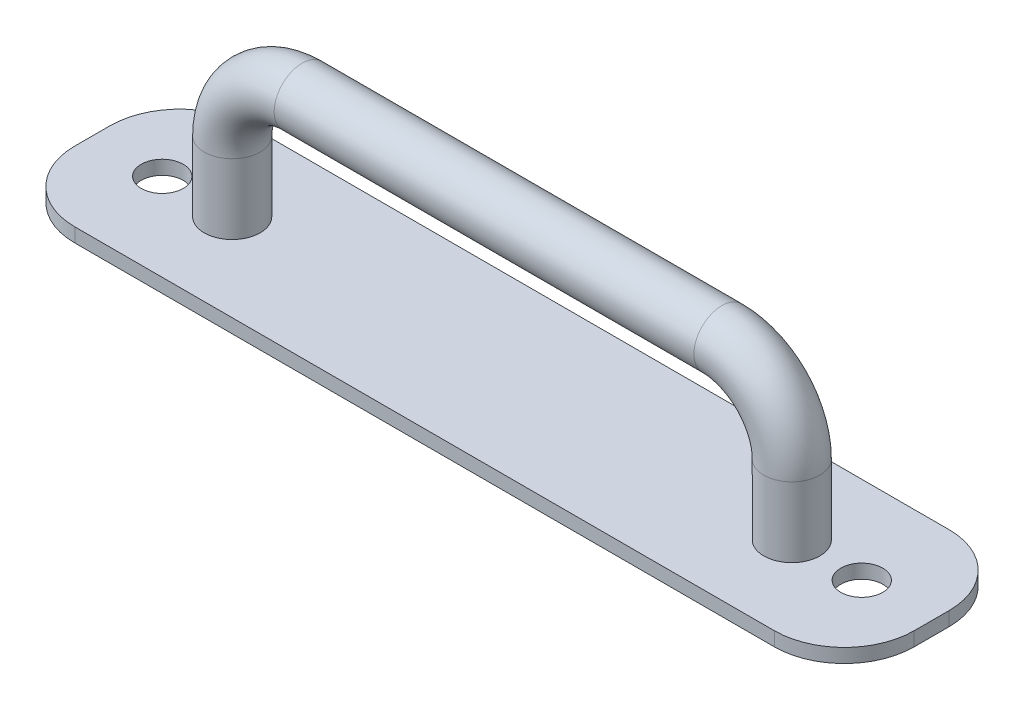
from build123d import *

# Parameters (mm, degrees)
SKETCH_1_W            = 120
SKETCH_1_H            = 25
EXTRUDE_1_DEPTH       = 2
SKETCH_3_R            = 4
HOLE_WIZARD_6_0_6_1_D = 6
FILLET_1_R            = 10


with BuildPart() as part:
    # Sketch 1 → Extrude 1 (new body)
    with BuildSketch(Plane(origin=(0, 0, 0), x_dir=(1, 0, 0), z_dir=(0, 1, 0))):
        Rectangle(SKETCH_1_W, SKETCH_1_H)
    extrude(amount=EXTRUDE_1_DEPTH)

    # Sweep 1: sweep along a path in Sketch 2
    with BuildLine(Plane.XY) as sweep_1_path:
        Line((-40, 2), (-40, 12))
        ThreePointArc((-40, 12), (-37.071067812, 19.071067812), (-30, 22))
        Line((-30, 22), (30, 22))
        ThreePointArc((30, 22), (37.071067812, 19.071067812), (40, 12))
        Line((40, 12), (40, 2))
    # Sketch 3 → Sweep 1 (sweep)
    with BuildSketch(Plane(origin=(0, 2, 0), x_dir=(1, 0, 0), z_dir=(0, 1, 0))):
        with Locations((-40, 0)):
            Circle(SKETCH_3_R)
    sweep(path=sweep_1_path.line)

    # Hole Wizard 6.0 _6_ _1 (through all)
    with Locations(Plane(origin=(0, 2, 0), x_dir=(1, 0, 0), z_dir=(0, 1, 0))):
        with Locations((-50, 0), (50, 0)):
            Hole(HOLE_WIZARD_6_0_6_1_D / 2)

    # Fillet 1
    fillet_1_edges = [part.edges().sort_by_distance(p)[0] for p in [
        (60, 1, 12.5),
        (-60, 1, 12.5),
        (-60, 1, -12.5),
        (60, 1, -12.5),
    ]]
    fillet(fillet_1_edges, radius=FILLET_1_R)


solid = part.part
